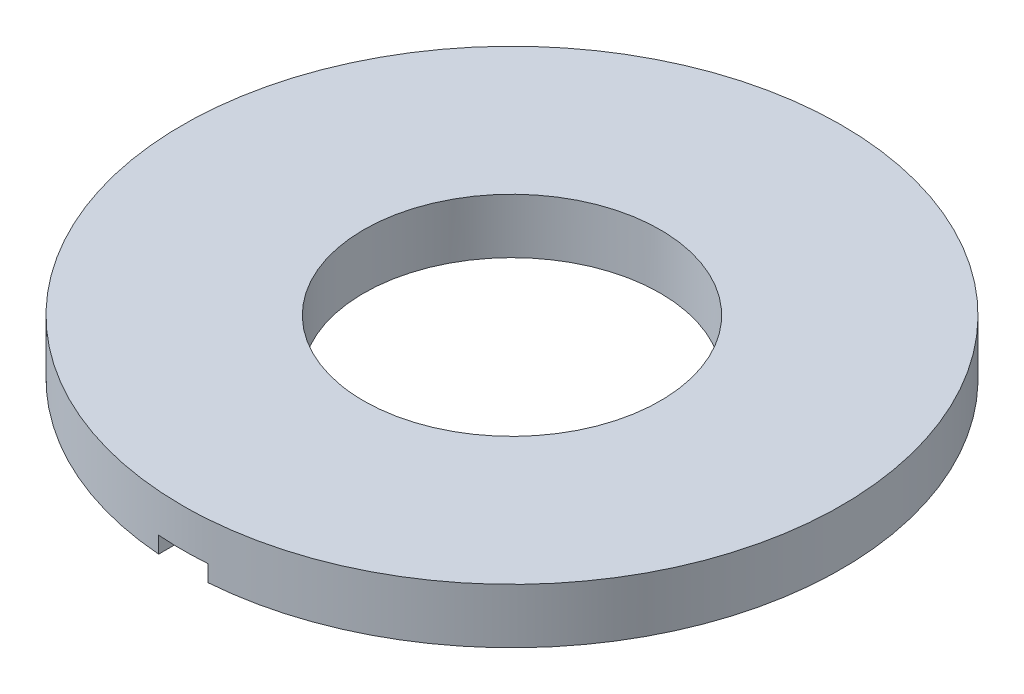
from build123d import *

# Parameters (mm, degrees)
SKETCH1_R          = 3
SKETCH1_R_2        = 1.35
EXTRUDE1_DEPTH     = 0.5
SKETCH2_W          = 0.45
SKETCH2_H          = 3.3
CUT_EXTRUDE1_DEPTH = 0.15


with BuildPart() as part:
    # Sketch1 → Extrude1 (new body)
    with BuildSketch(Plane(origin=(0, 0, 0), x_dir=(1, 0, 0), z_dir=(0, 1, 0))):
        with Locations(Location((0, 0, 0), (0, 0, 270))):
            Circle(SKETCH1_R)
        with Locations(Location((0, 0, 0), (0, 0, 270))):
            Circle(SKETCH1_R_2, mode=Mode.SUBTRACT)
    extrude(amount=EXTRUDE1_DEPTH)

    # Sketch2 → Cut-Extrude1 (cut)
    with BuildSketch(Plane.XZ):
        with Locations((0, 1.35)):
            Rectangle(SKETCH2_W, SKETCH2_H)
    extrude(amount=-CUT_EXTRUDE1_DEPTH, mode=Mode.SUBTRACT)


solid = part.part
